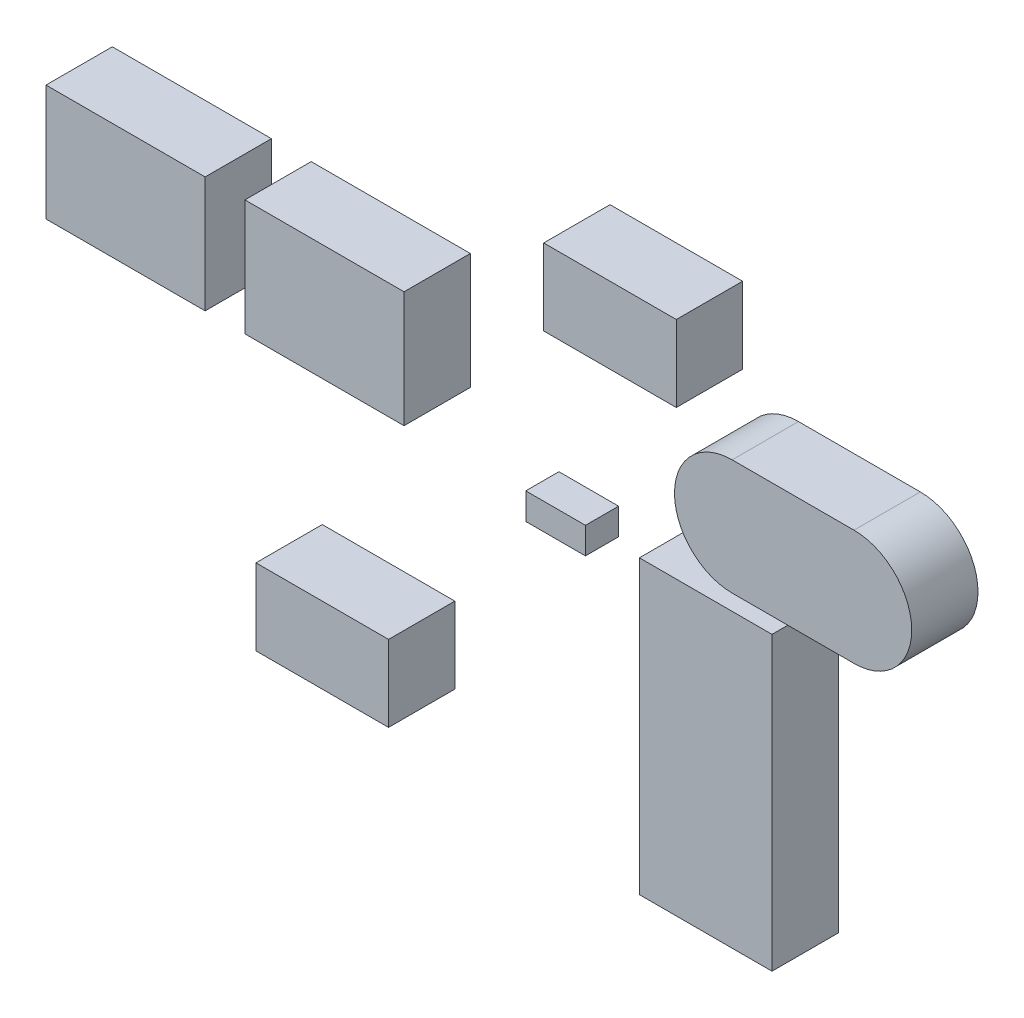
ISO-10303-21;
HEADER;
FILE_DESCRIPTION(('STEP AP214'),'2;1');
FILE_NAME('part.step','',(''),(''),'','','');
FILE_SCHEMA(('AUTOMOTIVE_DESIGN { 1 0 10303 214 1 1 1 1 }'));
ENDSEC;
DATA;
#1=APPLICATION_CONTEXT('core data for automotive mechanical design processes');
#2=APPLICATION_PROTOCOL_DEFINITION('international standard','automotive_design',2000,#1);
#3=PRODUCT_CONTEXT('',#1,'mechanical');
#4=PRODUCT('Part','Part','',(#3));
#5=PRODUCT_RELATED_PRODUCT_CATEGORY('part','',(#4));
#6=PRODUCT_DEFINITION_FORMATION('','',#4);
#7=PRODUCT_DEFINITION_CONTEXT('part definition',#1,'design');
#8=PRODUCT_DEFINITION('design','',#6,#7);
#9=PRODUCT_DEFINITION_SHAPE('','',#8);
#10=(LENGTH_UNIT() NAMED_UNIT(*) SI_UNIT(.MILLI.,.METRE.));
#11=(NAMED_UNIT(*) PLANE_ANGLE_UNIT() SI_UNIT($,.RADIAN.));
#12=(NAMED_UNIT(*) SI_UNIT($,.STERADIAN.) SOLID_ANGLE_UNIT());
#13=UNCERTAINTY_MEASURE_WITH_UNIT(LENGTH_MEASURE(1.E-05),#10,'distance_accuracy_value','');
#14=(GEOMETRIC_REPRESENTATION_CONTEXT(3) GLOBAL_UNCERTAINTY_ASSIGNED_CONTEXT((#13)) GLOBAL_UNIT_ASSIGNED_CONTEXT((#10,
#11,#12)) REPRESENTATION_CONTEXT('',''));
#15=CARTESIAN_POINT('',(0.,0.,0.));
#16=DIRECTION('',(0.,0.,1.));
#17=DIRECTION('',(1.,0.,0.));
#18=AXIS2_PLACEMENT_3D('',#15,#16,#17);
#19=CARTESIAN_POINT('',(10.5501527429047,30.8200326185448,2.));
#20=DIRECTION('',(1.,0.,0.));
#21=DIRECTION('',(0.,0.,-1.));
#22=AXIS2_PLACEMENT_3D('',#19,#20,#21);
#23=PLANE('',#22);
#24=DIRECTION('',(0.,-1.,0.));
#25=VECTOR('',#24,1.);
#26=CARTESIAN_POINT('',(10.5501527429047,30.8200326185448,0.));
#27=LINE('',#26,#25);
#28=CARTESIAN_POINT('',(10.5501527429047,30.8200326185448,0.));
#29=VERTEX_POINT('',#28);
#30=CARTESIAN_POINT('',(10.5501527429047,27.3200326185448,0.));
#31=VERTEX_POINT('',#30);
#32=EDGE_CURVE('P0_E80',#29,#31,#27,.T.);
#33=ORIENTED_EDGE('',*,*,#32,.T.);
#34=DIRECTION('',(0.,0.,-1.));
#35=VECTOR('',#34,1.);
#36=CARTESIAN_POINT('',(10.5501527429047,27.3200326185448,2.));
#37=LINE('',#36,#35);
#38=CARTESIAN_POINT('',(10.5501527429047,27.3200326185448,2.));
#39=VERTEX_POINT('',#38);
#40=EDGE_CURVE('P0_E11',#39,#31,#37,.T.);
#41=ORIENTED_EDGE('',*,*,#40,.F.);
#42=DIRECTION('',(0.,-1.,0.));
#43=VECTOR('',#42,1.);
#44=CARTESIAN_POINT('',(10.5501527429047,30.8200326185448,2.));
#45=LINE('',#44,#43);
#46=CARTESIAN_POINT('',(10.5501527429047,30.8200326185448,2.));
#47=VERTEX_POINT('',#46);
#48=EDGE_CURVE('P0_E68',#47,#39,#45,.T.);
#49=ORIENTED_EDGE('',*,*,#48,.F.);
#50=DIRECTION('',(0.,0.,-1.));
#51=VECTOR('',#50,1.);
#52=CARTESIAN_POINT('',(10.5501527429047,30.8200326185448,2.));
#53=LINE('',#52,#51);
#54=EDGE_CURVE('P0_E76',#47,#29,#53,.T.);
#55=ORIENTED_EDGE('',*,*,#54,.T.);
#56=EDGE_LOOP('',(#33,#41,#49,#55));
#57=FACE_BOUND('',#56,.T.);
#58=ADVANCED_FACE('P0_F17',(#57),#23,.F.);
#59=CARTESIAN_POINT('',(10.5501527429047,27.3200326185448,2.));
#60=DIRECTION('',(0.,1.,0.));
#61=DIRECTION('',(0.,0.,1.));
#62=AXIS2_PLACEMENT_3D('',#59,#60,#61);
#63=PLANE('',#62);
#64=DIRECTION('',(1.,0.,0.));
#65=VECTOR('',#64,1.);
#66=CARTESIAN_POINT('',(10.5501527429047,27.3200326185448,0.));
#67=LINE('',#66,#65);
#68=CARTESIAN_POINT('',(15.3501527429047,27.3200326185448,0.));
#69=VERTEX_POINT('',#68);
#70=EDGE_CURVE('P0_E72',#31,#69,#67,.T.);
#71=ORIENTED_EDGE('',*,*,#70,.T.);
#72=DIRECTION('',(0.,0.,-1.));
#73=VECTOR('',#72,1.);
#74=CARTESIAN_POINT('',(15.3501527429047,27.3200326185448,2.));
#75=LINE('',#74,#73);
#76=CARTESIAN_POINT('',(15.3501527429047,27.3200326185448,2.));
#77=VERTEX_POINT('',#76);
#78=EDGE_CURVE('P0_E25',#77,#69,#75,.T.);
#79=ORIENTED_EDGE('',*,*,#78,.F.);
#80=DIRECTION('',(1.,0.,0.));
#81=VECTOR('',#80,1.);
#82=CARTESIAN_POINT('',(10.5501527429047,27.3200326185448,2.));
#83=LINE('',#82,#81);
#84=EDGE_CURVE('P0_E63',#39,#77,#83,.T.);
#85=ORIENTED_EDGE('',*,*,#84,.F.);
#86=ORIENTED_EDGE('',*,*,#40,.T.);
#87=EDGE_LOOP('',(#71,#79,#85,#86));
#88=FACE_BOUND('',#87,.T.);
#89=ADVANCED_FACE('P0_F71',(#88),#63,.F.);
#90=CARTESIAN_POINT('',(15.3501527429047,30.8200326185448,2.));
#91=DIRECTION('',(-1.,0.,0.));
#92=DIRECTION('',(0.,0.,1.));
#93=AXIS2_PLACEMENT_3D('',#90,#91,#92);
#94=PLANE('',#93);
#95=DIRECTION('',(0.,1.,0.));
#96=VECTOR('',#95,1.);
#97=CARTESIAN_POINT('',(15.3501527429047,30.8200326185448,0.));
#98=LINE('',#97,#96);
#99=CARTESIAN_POINT('',(15.3501527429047,30.8200326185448,0.));
#100=VERTEX_POINT('',#99);
#101=EDGE_CURVE('P0_E50',#69,#100,#98,.T.);
#102=ORIENTED_EDGE('',*,*,#101,.T.);
#103=DIRECTION('',(0.,0.,-1.));
#104=VECTOR('',#103,1.);
#105=CARTESIAN_POINT('',(15.3501527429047,30.8200326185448,2.));
#106=LINE('',#105,#104);
#107=CARTESIAN_POINT('',(15.3501527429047,30.8200326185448,2.));
#108=VERTEX_POINT('',#107);
#109=EDGE_CURVE('P0_E73',#108,#100,#106,.T.);
#110=ORIENTED_EDGE('',*,*,#109,.F.);
#111=DIRECTION('',(0.,1.,0.));
#112=VECTOR('',#111,1.);
#113=CARTESIAN_POINT('',(15.3501527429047,30.8200326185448,2.));
#114=LINE('',#113,#112);
#115=EDGE_CURVE('P0_E66',#77,#108,#114,.T.);
#116=ORIENTED_EDGE('',*,*,#115,.F.);
#117=ORIENTED_EDGE('',*,*,#78,.T.);
#118=EDGE_LOOP('',(#102,#110,#116,#117));
#119=FACE_BOUND('',#118,.T.);
#120=ADVANCED_FACE('P0_F74',(#119),#94,.F.);
#121=CARTESIAN_POINT('',(10.5501527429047,30.8200326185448,2.));
#122=DIRECTION('',(0.,-1.,0.));
#123=DIRECTION('',(0.,0.,-1.));
#124=AXIS2_PLACEMENT_3D('',#121,#122,#123);
#125=PLANE('',#124);
#126=DIRECTION('',(-1.,0.,0.));
#127=VECTOR('',#126,1.);
#128=CARTESIAN_POINT('',(10.5501527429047,30.8200326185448,0.));
#129=LINE('',#128,#127);
#130=EDGE_CURVE('P0_E56',#100,#29,#129,.T.);
#131=ORIENTED_EDGE('',*,*,#130,.T.);
#132=ORIENTED_EDGE('',*,*,#54,.F.);
#133=DIRECTION('',(-1.,0.,0.));
#134=VECTOR('',#133,1.);
#135=CARTESIAN_POINT('',(10.5501527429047,30.8200326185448,2.));
#136=LINE('',#135,#134);
#137=EDGE_CURVE('P0_E33',#108,#47,#136,.T.);
#138=ORIENTED_EDGE('',*,*,#137,.F.);
#139=ORIENTED_EDGE('',*,*,#109,.T.);
#140=EDGE_LOOP('',(#131,#132,#138,#139));
#141=FACE_BOUND('',#140,.T.);
#142=ADVANCED_FACE('P0_F87',(#141),#125,.F.);
#143=CARTESIAN_POINT('',(0.,0.,2.));
#144=DIRECTION('',(0.,0.,1.));
#145=DIRECTION('',(1.,0.,0.));
#146=AXIS2_PLACEMENT_3D('',#143,#144,#145);
#147=PLANE('',#146);
#148=ORIENTED_EDGE('',*,*,#48,.T.);
#149=ORIENTED_EDGE('',*,*,#84,.T.);
#150=ORIENTED_EDGE('',*,*,#115,.T.);
#151=ORIENTED_EDGE('',*,*,#137,.T.);
#152=EDGE_LOOP('',(#148,#149,#150,#151));
#153=FACE_BOUND('',#152,.T.);
#154=ADVANCED_FACE('P0_F64',(#153),#147,.T.);
#155=CARTESIAN_POINT('',(0.,0.,0.));
#156=DIRECTION('',(0.,0.,1.));
#157=DIRECTION('',(1.,0.,0.));
#158=AXIS2_PLACEMENT_3D('',#155,#156,#157);
#159=PLANE('',#158);
#160=ORIENTED_EDGE('',*,*,#32,.F.);
#161=ORIENTED_EDGE('',*,*,#130,.F.);
#162=ORIENTED_EDGE('',*,*,#101,.F.);
#163=ORIENTED_EDGE('',*,*,#70,.F.);
#164=EDGE_LOOP('',(#160,#161,#162,#163));
#165=FACE_BOUND('',#164,.T.);
#166=ADVANCED_FACE('P0_F90',(#165),#159,.F.);
#167=CLOSED_SHELL('',(#58,#89,#120,#142,#154,#166));
#168=MANIFOLD_SOLID_BREP('P0_B1',#167);
#169=CARTESIAN_POINT('',(16.5501527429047,30.8200326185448,2.));
#170=DIRECTION('',(1.,0.,0.));
#171=DIRECTION('',(0.,0.,-1.));
#172=AXIS2_PLACEMENT_3D('',#169,#170,#171);
#173=PLANE('',#172);
#174=DIRECTION('',(0.,-1.,0.));
#175=VECTOR('',#174,1.);
#176=CARTESIAN_POINT('',(16.5501527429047,30.8200326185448,0.));
#177=LINE('',#176,#175);
#178=CARTESIAN_POINT('',(16.5501527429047,30.8200326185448,0.));
#179=VERTEX_POINT('',#178);
#180=CARTESIAN_POINT('',(16.5501527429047,27.3200326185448,0.));
#181=VERTEX_POINT('',#180);
#182=EDGE_CURVE('P1_E80',#179,#181,#177,.T.);
#183=ORIENTED_EDGE('',*,*,#182,.T.);
#184=DIRECTION('',(0.,0.,-1.));
#185=VECTOR('',#184,1.);
#186=CARTESIAN_POINT('',(16.5501527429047,27.3200326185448,2.));
#187=LINE('',#186,#185);
#188=CARTESIAN_POINT('',(16.5501527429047,27.3200326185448,2.));
#189=VERTEX_POINT('',#188);
#190=EDGE_CURVE('P1_E11',#189,#181,#187,.T.);
#191=ORIENTED_EDGE('',*,*,#190,.F.);
#192=DIRECTION('',(0.,-1.,0.));
#193=VECTOR('',#192,1.);
#194=CARTESIAN_POINT('',(16.5501527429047,30.8200326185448,2.));
#195=LINE('',#194,#193);
#196=CARTESIAN_POINT('',(16.5501527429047,30.8200326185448,2.));
#197=VERTEX_POINT('',#196);
#198=EDGE_CURVE('P1_E68',#197,#189,#195,.T.);
#199=ORIENTED_EDGE('',*,*,#198,.F.);
#200=DIRECTION('',(0.,0.,-1.));
#201=VECTOR('',#200,1.);
#202=CARTESIAN_POINT('',(16.5501527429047,30.8200326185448,2.));
#203=LINE('',#202,#201);
#204=EDGE_CURVE('P1_E76',#197,#179,#203,.T.);
#205=ORIENTED_EDGE('',*,*,#204,.T.);
#206=EDGE_LOOP('',(#183,#191,#199,#205));
#207=FACE_BOUND('',#206,.T.);
#208=ADVANCED_FACE('P1_F17',(#207),#173,.F.);
#209=CARTESIAN_POINT('',(16.5501527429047,27.3200326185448,2.));
#210=DIRECTION('',(0.,1.,0.));
#211=DIRECTION('',(0.,0.,1.));
#212=AXIS2_PLACEMENT_3D('',#209,#210,#211);
#213=PLANE('',#212);
#214=DIRECTION('',(1.,0.,0.));
#215=VECTOR('',#214,1.);
#216=CARTESIAN_POINT('',(16.5501527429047,27.3200326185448,0.));
#217=LINE('',#216,#215);
#218=CARTESIAN_POINT('',(21.3501527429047,27.3200326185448,0.));
#219=VERTEX_POINT('',#218);
#220=EDGE_CURVE('P1_E72',#181,#219,#217,.T.);
#221=ORIENTED_EDGE('',*,*,#220,.T.);
#222=DIRECTION('',(0.,0.,-1.));
#223=VECTOR('',#222,1.);
#224=CARTESIAN_POINT('',(21.3501527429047,27.3200326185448,2.));
#225=LINE('',#224,#223);
#226=CARTESIAN_POINT('',(21.3501527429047,27.3200326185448,2.));
#227=VERTEX_POINT('',#226);
#228=EDGE_CURVE('P1_E25',#227,#219,#225,.T.);
#229=ORIENTED_EDGE('',*,*,#228,.F.);
#230=DIRECTION('',(1.,0.,0.));
#231=VECTOR('',#230,1.);
#232=CARTESIAN_POINT('',(16.5501527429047,27.3200326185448,2.));
#233=LINE('',#232,#231);
#234=EDGE_CURVE('P1_E63',#189,#227,#233,.T.);
#235=ORIENTED_EDGE('',*,*,#234,.F.);
#236=ORIENTED_EDGE('',*,*,#190,.T.);
#237=EDGE_LOOP('',(#221,#229,#235,#236));
#238=FACE_BOUND('',#237,.T.);
#239=ADVANCED_FACE('P1_F71',(#238),#213,.F.);
#240=CARTESIAN_POINT('',(21.3501527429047,30.8200326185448,2.));
#241=DIRECTION('',(-1.,0.,0.));
#242=DIRECTION('',(0.,0.,1.));
#243=AXIS2_PLACEMENT_3D('',#240,#241,#242);
#244=PLANE('',#243);
#245=DIRECTION('',(0.,1.,0.));
#246=VECTOR('',#245,1.);
#247=CARTESIAN_POINT('',(21.3501527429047,30.8200326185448,0.));
#248=LINE('',#247,#246);
#249=CARTESIAN_POINT('',(21.3501527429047,30.8200326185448,0.));
#250=VERTEX_POINT('',#249);
#251=EDGE_CURVE('P1_E50',#219,#250,#248,.T.);
#252=ORIENTED_EDGE('',*,*,#251,.T.);
#253=DIRECTION('',(0.,0.,-1.));
#254=VECTOR('',#253,1.);
#255=CARTESIAN_POINT('',(21.3501527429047,30.8200326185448,2.));
#256=LINE('',#255,#254);
#257=CARTESIAN_POINT('',(21.3501527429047,30.8200326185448,2.));
#258=VERTEX_POINT('',#257);
#259=EDGE_CURVE('P1_E73',#258,#250,#256,.T.);
#260=ORIENTED_EDGE('',*,*,#259,.F.);
#261=DIRECTION('',(0.,1.,0.));
#262=VECTOR('',#261,1.);
#263=CARTESIAN_POINT('',(21.3501527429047,30.8200326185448,2.));
#264=LINE('',#263,#262);
#265=EDGE_CURVE('P1_E66',#227,#258,#264,.T.);
#266=ORIENTED_EDGE('',*,*,#265,.F.);
#267=ORIENTED_EDGE('',*,*,#228,.T.);
#268=EDGE_LOOP('',(#252,#260,#266,#267));
#269=FACE_BOUND('',#268,.T.);
#270=ADVANCED_FACE('P1_F74',(#269),#244,.F.);
#271=CARTESIAN_POINT('',(16.5501527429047,30.8200326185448,2.));
#272=DIRECTION('',(0.,-1.,0.));
#273=DIRECTION('',(0.,0.,-1.));
#274=AXIS2_PLACEMENT_3D('',#271,#272,#273);
#275=PLANE('',#274);
#276=DIRECTION('',(-1.,0.,0.));
#277=VECTOR('',#276,1.);
#278=CARTESIAN_POINT('',(16.5501527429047,30.8200326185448,0.));
#279=LINE('',#278,#277);
#280=EDGE_CURVE('P1_E56',#250,#179,#279,.T.);
#281=ORIENTED_EDGE('',*,*,#280,.T.);
#282=ORIENTED_EDGE('',*,*,#204,.F.);
#283=DIRECTION('',(-1.,0.,0.));
#284=VECTOR('',#283,1.);
#285=CARTESIAN_POINT('',(16.5501527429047,30.8200326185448,2.));
#286=LINE('',#285,#284);
#287=EDGE_CURVE('P1_E33',#258,#197,#286,.T.);
#288=ORIENTED_EDGE('',*,*,#287,.F.);
#289=ORIENTED_EDGE('',*,*,#259,.T.);
#290=EDGE_LOOP('',(#281,#282,#288,#289));
#291=FACE_BOUND('',#290,.T.);
#292=ADVANCED_FACE('P1_F87',(#291),#275,.F.);
#293=CARTESIAN_POINT('',(0.,0.,2.));
#294=DIRECTION('',(0.,0.,1.));
#295=DIRECTION('',(1.,0.,0.));
#296=AXIS2_PLACEMENT_3D('',#293,#294,#295);
#297=PLANE('',#296);
#298=ORIENTED_EDGE('',*,*,#198,.T.);
#299=ORIENTED_EDGE('',*,*,#234,.T.);
#300=ORIENTED_EDGE('',*,*,#265,.T.);
#301=ORIENTED_EDGE('',*,*,#287,.T.);
#302=EDGE_LOOP('',(#298,#299,#300,#301));
#303=FACE_BOUND('',#302,.T.);
#304=ADVANCED_FACE('P1_F64',(#303),#297,.T.);
#305=CARTESIAN_POINT('',(0.,0.,0.));
#306=DIRECTION('',(0.,0.,1.));
#307=DIRECTION('',(1.,0.,0.));
#308=AXIS2_PLACEMENT_3D('',#305,#306,#307);
#309=PLANE('',#308);
#310=ORIENTED_EDGE('',*,*,#182,.F.);
#311=ORIENTED_EDGE('',*,*,#280,.F.);
#312=ORIENTED_EDGE('',*,*,#251,.F.);
#313=ORIENTED_EDGE('',*,*,#220,.F.);
#314=EDGE_LOOP('',(#310,#311,#312,#313));
#315=FACE_BOUND('',#314,.T.);
#316=ADVANCED_FACE('P1_F90',(#315),#309,.F.);
#317=CLOSED_SHELL('',(#208,#239,#270,#292,#304,#316));
#318=MANIFOLD_SOLID_BREP('P1_B1',#317);
#319=CARTESIAN_POINT('',(28.4501527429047,27.4200326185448,2.));
#320=DIRECTION('',(1.,0.,0.));
#321=DIRECTION('',(0.,0.,-1.));
#322=AXIS2_PLACEMENT_3D('',#319,#320,#321);
#323=PLANE('',#322);
#324=DIRECTION('',(0.,-1.,0.));
#325=VECTOR('',#324,1.);
#326=CARTESIAN_POINT('',(28.4501527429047,27.4200326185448,0.));
#327=LINE('',#326,#325);
#328=CARTESIAN_POINT('',(28.4501527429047,27.4200326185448,0.));
#329=VERTEX_POINT('',#328);
#330=CARTESIAN_POINT('',(28.4501527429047,18.6200326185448,0.));
#331=VERTEX_POINT('',#330);
#332=EDGE_CURVE('P2_E80',#329,#331,#327,.T.);
#333=ORIENTED_EDGE('',*,*,#332,.T.);
#334=DIRECTION('',(0.,0.,-1.));
#335=VECTOR('',#334,1.);
#336=CARTESIAN_POINT('',(28.4501527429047,18.6200326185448,2.));
#337=LINE('',#336,#335);
#338=CARTESIAN_POINT('',(28.4501527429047,18.6200326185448,2.));
#339=VERTEX_POINT('',#338);
#340=EDGE_CURVE('P2_E11',#339,#331,#337,.T.);
#341=ORIENTED_EDGE('',*,*,#340,.F.);
#342=DIRECTION('',(0.,-1.,0.));
#343=VECTOR('',#342,1.);
#344=CARTESIAN_POINT('',(28.4501527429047,27.4200326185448,2.));
#345=LINE('',#344,#343);
#346=CARTESIAN_POINT('',(28.4501527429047,27.4200326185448,2.));
#347=VERTEX_POINT('',#346);
#348=EDGE_CURVE('P2_E68',#347,#339,#345,.T.);
#349=ORIENTED_EDGE('',*,*,#348,.F.);
#350=DIRECTION('',(0.,0.,-1.));
#351=VECTOR('',#350,1.);
#352=CARTESIAN_POINT('',(28.4501527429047,27.4200326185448,2.));
#353=LINE('',#352,#351);
#354=EDGE_CURVE('P2_E76',#347,#329,#353,.T.);
#355=ORIENTED_EDGE('',*,*,#354,.T.);
#356=EDGE_LOOP('',(#333,#341,#349,#355));
#357=FACE_BOUND('',#356,.T.);
#358=ADVANCED_FACE('P2_F17',(#357),#323,.F.);
#359=CARTESIAN_POINT('',(28.4501527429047,18.6200326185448,2.));
#360=DIRECTION('',(0.,1.,0.));
#361=DIRECTION('',(0.,0.,1.));
#362=AXIS2_PLACEMENT_3D('',#359,#360,#361);
#363=PLANE('',#362);
#364=DIRECTION('',(1.,0.,0.));
#365=VECTOR('',#364,1.);
#366=CARTESIAN_POINT('',(28.4501527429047,18.6200326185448,0.));
#367=LINE('',#366,#365);
#368=CARTESIAN_POINT('',(32.4501527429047,18.6200326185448,0.));
#369=VERTEX_POINT('',#368);
#370=EDGE_CURVE('P2_E72',#331,#369,#367,.T.);
#371=ORIENTED_EDGE('',*,*,#370,.T.);
#372=DIRECTION('',(0.,0.,-1.));
#373=VECTOR('',#372,1.);
#374=CARTESIAN_POINT('',(32.4501527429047,18.6200326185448,2.));
#375=LINE('',#374,#373);
#376=CARTESIAN_POINT('',(32.4501527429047,18.6200326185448,2.));
#377=VERTEX_POINT('',#376);
#378=EDGE_CURVE('P2_E25',#377,#369,#375,.T.);
#379=ORIENTED_EDGE('',*,*,#378,.F.);
#380=DIRECTION('',(1.,0.,0.));
#381=VECTOR('',#380,1.);
#382=CARTESIAN_POINT('',(28.4501527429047,18.6200326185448,2.));
#383=LINE('',#382,#381);
#384=EDGE_CURVE('P2_E63',#339,#377,#383,.T.);
#385=ORIENTED_EDGE('',*,*,#384,.F.);
#386=ORIENTED_EDGE('',*,*,#340,.T.);
#387=EDGE_LOOP('',(#371,#379,#385,#386));
#388=FACE_BOUND('',#387,.T.);
#389=ADVANCED_FACE('P2_F71',(#388),#363,.F.);
#390=CARTESIAN_POINT('',(32.4501527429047,27.4200326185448,2.));
#391=DIRECTION('',(-1.,0.,0.));
#392=DIRECTION('',(0.,0.,1.));
#393=AXIS2_PLACEMENT_3D('',#390,#391,#392);
#394=PLANE('',#393);
#395=DIRECTION('',(0.,1.,0.));
#396=VECTOR('',#395,1.);
#397=CARTESIAN_POINT('',(32.4501527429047,27.4200326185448,0.));
#398=LINE('',#397,#396);
#399=CARTESIAN_POINT('',(32.4501527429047,27.4200326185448,0.));
#400=VERTEX_POINT('',#399);
#401=EDGE_CURVE('P2_E50',#369,#400,#398,.T.);
#402=ORIENTED_EDGE('',*,*,#401,.T.);
#403=DIRECTION('',(0.,0.,-1.));
#404=VECTOR('',#403,1.);
#405=CARTESIAN_POINT('',(32.4501527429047,27.4200326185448,2.));
#406=LINE('',#405,#404);
#407=CARTESIAN_POINT('',(32.4501527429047,27.4200326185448,2.));
#408=VERTEX_POINT('',#407);
#409=EDGE_CURVE('P2_E73',#408,#400,#406,.T.);
#410=ORIENTED_EDGE('',*,*,#409,.F.);
#411=DIRECTION('',(0.,1.,0.));
#412=VECTOR('',#411,1.);
#413=CARTESIAN_POINT('',(32.4501527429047,27.4200326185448,2.));
#414=LINE('',#413,#412);
#415=EDGE_CURVE('P2_E66',#377,#408,#414,.T.);
#416=ORIENTED_EDGE('',*,*,#415,.F.);
#417=ORIENTED_EDGE('',*,*,#378,.T.);
#418=EDGE_LOOP('',(#402,#410,#416,#417));
#419=FACE_BOUND('',#418,.T.);
#420=ADVANCED_FACE('P2_F74',(#419),#394,.F.);
#421=CARTESIAN_POINT('',(28.4501527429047,27.4200326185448,2.));
#422=DIRECTION('',(0.,-1.,0.));
#423=DIRECTION('',(0.,0.,-1.));
#424=AXIS2_PLACEMENT_3D('',#421,#422,#423);
#425=PLANE('',#424);
#426=DIRECTION('',(-1.,0.,0.));
#427=VECTOR('',#426,1.);
#428=CARTESIAN_POINT('',(28.4501527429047,27.4200326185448,0.));
#429=LINE('',#428,#427);
#430=EDGE_CURVE('P2_E56',#400,#329,#429,.T.);
#431=ORIENTED_EDGE('',*,*,#430,.T.);
#432=ORIENTED_EDGE('',*,*,#354,.F.);
#433=DIRECTION('',(-1.,0.,0.));
#434=VECTOR('',#433,1.);
#435=CARTESIAN_POINT('',(28.4501527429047,27.4200326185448,2.));
#436=LINE('',#435,#434);
#437=EDGE_CURVE('P2_E33',#408,#347,#436,.T.);
#438=ORIENTED_EDGE('',*,*,#437,.F.);
#439=ORIENTED_EDGE('',*,*,#409,.T.);
#440=EDGE_LOOP('',(#431,#432,#438,#439));
#441=FACE_BOUND('',#440,.T.);
#442=ADVANCED_FACE('P2_F87',(#441),#425,.F.);
#443=CARTESIAN_POINT('',(0.,0.,2.));
#444=DIRECTION('',(0.,0.,1.));
#445=DIRECTION('',(1.,0.,0.));
#446=AXIS2_PLACEMENT_3D('',#443,#444,#445);
#447=PLANE('',#446);
#448=ORIENTED_EDGE('',*,*,#348,.T.);
#449=ORIENTED_EDGE('',*,*,#384,.T.);
#450=ORIENTED_EDGE('',*,*,#415,.T.);
#451=ORIENTED_EDGE('',*,*,#437,.T.);
#452=EDGE_LOOP('',(#448,#449,#450,#451));
#453=FACE_BOUND('',#452,.T.);
#454=ADVANCED_FACE('P2_F64',(#453),#447,.T.);
#455=CARTESIAN_POINT('',(0.,0.,0.));
#456=DIRECTION('',(0.,0.,1.));
#457=DIRECTION('',(1.,0.,0.));
#458=AXIS2_PLACEMENT_3D('',#455,#456,#457);
#459=PLANE('',#458);
#460=ORIENTED_EDGE('',*,*,#332,.F.);
#461=ORIENTED_EDGE('',*,*,#430,.F.);
#462=ORIENTED_EDGE('',*,*,#401,.F.);
#463=ORIENTED_EDGE('',*,*,#370,.F.);
#464=EDGE_LOOP('',(#460,#461,#462,#463));
#465=FACE_BOUND('',#464,.T.);
#466=ADVANCED_FACE('P2_F90',(#465),#459,.F.);
#467=CLOSED_SHELL('',(#358,#389,#420,#442,#454,#466));
#468=MANIFOLD_SOLID_BREP('P2_B1',#467);
#469=CARTESIAN_POINT('',(29.5633014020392,34.2019934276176,2.));
#470=DIRECTION('',(-1.,0.,0.));
#471=DIRECTION('',(0.,0.,1.));
#472=AXIS2_PLACEMENT_3D('',#469,#470,#471);
#473=PLANE('',#472);
#474=DIRECTION('',(0.,1.,0.));
#475=VECTOR('',#474,1.);
#476=CARTESIAN_POINT('',(29.5633014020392,34.2019934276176,0.));
#477=LINE('',#476,#475);
#478=CARTESIAN_POINT('',(29.5633014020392,31.9019934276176,0.));
#479=VERTEX_POINT('',#478);
#480=CARTESIAN_POINT('',(29.5633014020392,34.2019934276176,0.));
#481=VERTEX_POINT('',#480);
#482=EDGE_CURVE('P3_E80',#479,#481,#477,.T.);
#483=ORIENTED_EDGE('',*,*,#482,.T.);
#484=DIRECTION('',(0.,0.,-1.));
#485=VECTOR('',#484,1.);
#486=CARTESIAN_POINT('',(29.5633014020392,34.2019934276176,2.));
#487=LINE('',#486,#485);
#488=CARTESIAN_POINT('',(29.5633014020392,34.2019934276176,2.));
#489=VERTEX_POINT('',#488);
#490=EDGE_CURVE('P3_E11',#489,#481,#487,.T.);
#491=ORIENTED_EDGE('',*,*,#490,.F.);
#492=DIRECTION('',(0.,1.,0.));
#493=VECTOR('',#492,1.);
#494=CARTESIAN_POINT('',(29.5633014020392,34.2019934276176,2.));
#495=LINE('',#494,#493);
#496=CARTESIAN_POINT('',(29.5633014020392,31.9019934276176,2.));
#497=VERTEX_POINT('',#496);
#498=EDGE_CURVE('P3_E68',#497,#489,#495,.T.);
#499=ORIENTED_EDGE('',*,*,#498,.F.);
#500=DIRECTION('',(0.,0.,-1.));
#501=VECTOR('',#500,1.);
#502=CARTESIAN_POINT('',(29.5633014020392,31.9019934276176,2.));
#503=LINE('',#502,#501);
#504=EDGE_CURVE('P3_E76',#497,#479,#503,.T.);
#505=ORIENTED_EDGE('',*,*,#504,.T.);
#506=EDGE_LOOP('',(#483,#491,#499,#505));
#507=FACE_BOUND('',#506,.T.);
#508=ADVANCED_FACE('P3_F17',(#507),#473,.F.);
#509=CARTESIAN_POINT('',(29.5633014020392,34.2019934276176,2.));
#510=DIRECTION('',(0.,-1.,0.));
#511=DIRECTION('',(0.,0.,-1.));
#512=AXIS2_PLACEMENT_3D('',#509,#510,#511);
#513=PLANE('',#512);
#514=DIRECTION('',(-1.,0.,0.));
#515=VECTOR('',#514,1.);
#516=CARTESIAN_POINT('',(29.5633014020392,34.2019934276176,0.));
#517=LINE('',#516,#515);
#518=CARTESIAN_POINT('',(25.5633014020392,34.2019934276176,0.));
#519=VERTEX_POINT('',#518);
#520=EDGE_CURVE('P3_E72',#481,#519,#517,.T.);
#521=ORIENTED_EDGE('',*,*,#520,.T.);
#522=DIRECTION('',(0.,0.,-1.));
#523=VECTOR('',#522,1.);
#524=CARTESIAN_POINT('',(25.5633014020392,34.2019934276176,2.));
#525=LINE('',#524,#523);
#526=CARTESIAN_POINT('',(25.5633014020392,34.2019934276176,2.));
#527=VERTEX_POINT('',#526);
#528=EDGE_CURVE('P3_E25',#527,#519,#525,.T.);
#529=ORIENTED_EDGE('',*,*,#528,.F.);
#530=DIRECTION('',(-1.,0.,0.));
#531=VECTOR('',#530,1.);
#532=CARTESIAN_POINT('',(29.5633014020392,34.2019934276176,2.));
#533=LINE('',#532,#531);
#534=EDGE_CURVE('P3_E63',#489,#527,#533,.T.);
#535=ORIENTED_EDGE('',*,*,#534,.F.);
#536=ORIENTED_EDGE('',*,*,#490,.T.);
#537=EDGE_LOOP('',(#521,#529,#535,#536));
#538=FACE_BOUND('',#537,.T.);
#539=ADVANCED_FACE('P3_F71',(#538),#513,.F.);
#540=CARTESIAN_POINT('',(25.5633014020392,34.2019934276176,2.));
#541=DIRECTION('',(1.,0.,0.));
#542=DIRECTION('',(0.,0.,-1.));
#543=AXIS2_PLACEMENT_3D('',#540,#541,#542);
#544=PLANE('',#543);
#545=DIRECTION('',(0.,-1.,0.));
#546=VECTOR('',#545,1.);
#547=CARTESIAN_POINT('',(25.5633014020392,34.2019934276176,0.));
#548=LINE('',#547,#546);
#549=CARTESIAN_POINT('',(25.5633014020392,31.9019934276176,0.));
#550=VERTEX_POINT('',#549);
#551=EDGE_CURVE('P3_E50',#519,#550,#548,.T.);
#552=ORIENTED_EDGE('',*,*,#551,.T.);
#553=DIRECTION('',(0.,0.,-1.));
#554=VECTOR('',#553,1.);
#555=CARTESIAN_POINT('',(25.5633014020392,31.9019934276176,2.));
#556=LINE('',#555,#554);
#557=CARTESIAN_POINT('',(25.5633014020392,31.9019934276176,2.));
#558=VERTEX_POINT('',#557);
#559=EDGE_CURVE('P3_E73',#558,#550,#556,.T.);
#560=ORIENTED_EDGE('',*,*,#559,.F.);
#561=DIRECTION('',(0.,-1.,0.));
#562=VECTOR('',#561,1.);
#563=CARTESIAN_POINT('',(25.5633014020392,34.2019934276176,2.));
#564=LINE('',#563,#562);
#565=EDGE_CURVE('P3_E66',#527,#558,#564,.T.);
#566=ORIENTED_EDGE('',*,*,#565,.F.);
#567=ORIENTED_EDGE('',*,*,#528,.T.);
#568=EDGE_LOOP('',(#552,#560,#566,#567));
#569=FACE_BOUND('',#568,.T.);
#570=ADVANCED_FACE('P3_F74',(#569),#544,.F.);
#571=CARTESIAN_POINT('',(29.5633014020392,31.9019934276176,2.));
#572=DIRECTION('',(0.,1.,0.));
#573=DIRECTION('',(0.,0.,1.));
#574=AXIS2_PLACEMENT_3D('',#571,#572,#573);
#575=PLANE('',#574);
#576=DIRECTION('',(1.,0.,0.));
#577=VECTOR('',#576,1.);
#578=CARTESIAN_POINT('',(29.5633014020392,31.9019934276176,0.));
#579=LINE('',#578,#577);
#580=EDGE_CURVE('P3_E56',#550,#479,#579,.T.);
#581=ORIENTED_EDGE('',*,*,#580,.T.);
#582=ORIENTED_EDGE('',*,*,#504,.F.);
#583=DIRECTION('',(1.,0.,0.));
#584=VECTOR('',#583,1.);
#585=CARTESIAN_POINT('',(29.5633014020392,31.9019934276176,2.));
#586=LINE('',#585,#584);
#587=EDGE_CURVE('P3_E33',#558,#497,#586,.T.);
#588=ORIENTED_EDGE('',*,*,#587,.F.);
#589=ORIENTED_EDGE('',*,*,#559,.T.);
#590=EDGE_LOOP('',(#581,#582,#588,#589));
#591=FACE_BOUND('',#590,.T.);
#592=ADVANCED_FACE('P3_F87',(#591),#575,.F.);
#593=CARTESIAN_POINT('',(0.,0.,2.));
#594=DIRECTION('',(0.,0.,-1.));
#595=DIRECTION('',(-1.,0.,0.));
#596=AXIS2_PLACEMENT_3D('',#593,#594,#595);
#597=PLANE('',#596);
#598=ORIENTED_EDGE('',*,*,#498,.T.);
#599=ORIENTED_EDGE('',*,*,#534,.T.);
#600=ORIENTED_EDGE('',*,*,#565,.T.);
#601=ORIENTED_EDGE('',*,*,#587,.T.);
#602=EDGE_LOOP('',(#598,#599,#600,#601));
#603=FACE_BOUND('',#602,.T.);
#604=ADVANCED_FACE('P3_F64',(#603),#597,.F.);
#605=CARTESIAN_POINT('',(0.,0.,0.));
#606=DIRECTION('',(0.,0.,-1.));
#607=DIRECTION('',(-1.,0.,0.));
#608=AXIS2_PLACEMENT_3D('',#605,#606,#607);
#609=PLANE('',#608);
#610=ORIENTED_EDGE('',*,*,#482,.F.);
#611=ORIENTED_EDGE('',*,*,#580,.F.);
#612=ORIENTED_EDGE('',*,*,#551,.F.);
#613=ORIENTED_EDGE('',*,*,#520,.F.);
#614=EDGE_LOOP('',(#610,#611,#612,#613));
#615=FACE_BOUND('',#614,.T.);
#616=ADVANCED_FACE('P3_F90',(#615),#609,.T.);
#617=CLOSED_SHELL('',(#508,#539,#570,#592,#604,#616));
#618=MANIFOLD_SOLID_BREP('P3_B1',#617);
#619=CARTESIAN_POINT('',(20.8833029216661,21.5053863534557,2.));
#620=DIRECTION('',(-1.,0.,0.));
#621=DIRECTION('',(0.,-1.,0.));
#622=AXIS2_PLACEMENT_3D('',#619,#620,#621);
#623=PLANE('',#622);
#624=DIRECTION('',(0.,1.,0.));
#625=VECTOR('',#624,1.);
#626=CARTESIAN_POINT('',(20.8833029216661,21.5053863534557,0.));
#627=LINE('',#626,#625);
#628=CARTESIAN_POINT('',(20.8833029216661,19.2053863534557,0.));
#629=VERTEX_POINT('',#628);
#630=CARTESIAN_POINT('',(20.8833029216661,21.5053863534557,0.));
#631=VERTEX_POINT('',#630);
#632=EDGE_CURVE('P4_E80',#629,#631,#627,.T.);
#633=ORIENTED_EDGE('',*,*,#632,.T.);
#634=DIRECTION('',(0.,0.,-1.));
#635=VECTOR('',#634,1.);
#636=CARTESIAN_POINT('',(20.8833029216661,21.5053863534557,2.));
#637=LINE('',#636,#635);
#638=CARTESIAN_POINT('',(20.8833029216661,21.5053863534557,2.));
#639=VERTEX_POINT('',#638);
#640=EDGE_CURVE('P4_E11',#639,#631,#637,.T.);
#641=ORIENTED_EDGE('',*,*,#640,.F.);
#642=DIRECTION('',(0.,1.,0.));
#643=VECTOR('',#642,1.);
#644=CARTESIAN_POINT('',(20.8833029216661,21.5053863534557,2.));
#645=LINE('',#644,#643);
#646=CARTESIAN_POINT('',(20.8833029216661,19.2053863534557,2.));
#647=VERTEX_POINT('',#646);
#648=EDGE_CURVE('P4_E68',#647,#639,#645,.T.);
#649=ORIENTED_EDGE('',*,*,#648,.F.);
#650=DIRECTION('',(0.,0.,-1.));
#651=VECTOR('',#650,1.);
#652=CARTESIAN_POINT('',(20.8833029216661,19.2053863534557,2.));
#653=LINE('',#652,#651);
#654=EDGE_CURVE('P4_E76',#647,#629,#653,.T.);
#655=ORIENTED_EDGE('',*,*,#654,.T.);
#656=EDGE_LOOP('',(#633,#641,#649,#655));
#657=FACE_BOUND('',#656,.T.);
#658=ADVANCED_FACE('P4_F17',(#657),#623,.F.);
#659=CARTESIAN_POINT('',(20.8833029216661,21.5053863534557,2.));
#660=DIRECTION('',(0.,-1.,0.));
#661=DIRECTION('',(1.,0.,0.));
#662=AXIS2_PLACEMENT_3D('',#659,#660,#661);
#663=PLANE('',#662);
#664=DIRECTION('',(-1.,0.,0.));
#665=VECTOR('',#664,1.);
#666=CARTESIAN_POINT('',(20.8833029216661,21.5053863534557,0.));
#667=LINE('',#666,#665);
#668=CARTESIAN_POINT('',(16.8833029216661,21.5053863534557,0.));
#669=VERTEX_POINT('',#668);
#670=EDGE_CURVE('P4_E72',#631,#669,#667,.T.);
#671=ORIENTED_EDGE('',*,*,#670,.T.);
#672=DIRECTION('',(0.,0.,-1.));
#673=VECTOR('',#672,1.);
#674=CARTESIAN_POINT('',(16.8833029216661,21.5053863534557,2.));
#675=LINE('',#674,#673);
#676=CARTESIAN_POINT('',(16.8833029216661,21.5053863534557,2.));
#677=VERTEX_POINT('',#676);
#678=EDGE_CURVE('P4_E25',#677,#669,#675,.T.);
#679=ORIENTED_EDGE('',*,*,#678,.F.);
#680=DIRECTION('',(-1.,0.,0.));
#681=VECTOR('',#680,1.);
#682=CARTESIAN_POINT('',(20.8833029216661,21.5053863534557,2.));
#683=LINE('',#682,#681);
#684=EDGE_CURVE('P4_E63',#639,#677,#683,.T.);
#685=ORIENTED_EDGE('',*,*,#684,.F.);
#686=ORIENTED_EDGE('',*,*,#640,.T.);
#687=EDGE_LOOP('',(#671,#679,#685,#686));
#688=FACE_BOUND('',#687,.T.);
#689=ADVANCED_FACE('P4_F71',(#688),#663,.F.);
#690=CARTESIAN_POINT('',(16.8833029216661,21.5053863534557,2.));
#691=DIRECTION('',(1.,0.,0.));
#692=DIRECTION('',(0.,1.,0.));
#693=AXIS2_PLACEMENT_3D('',#690,#691,#692);
#694=PLANE('',#693);
#695=DIRECTION('',(0.,-1.,0.));
#696=VECTOR('',#695,1.);
#697=CARTESIAN_POINT('',(16.8833029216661,21.5053863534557,0.));
#698=LINE('',#697,#696);
#699=CARTESIAN_POINT('',(16.8833029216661,19.2053863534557,0.));
#700=VERTEX_POINT('',#699);
#701=EDGE_CURVE('P4_E50',#669,#700,#698,.T.);
#702=ORIENTED_EDGE('',*,*,#701,.T.);
#703=DIRECTION('',(0.,0.,-1.));
#704=VECTOR('',#703,1.);
#705=CARTESIAN_POINT('',(16.8833029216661,19.2053863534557,2.));
#706=LINE('',#705,#704);
#707=CARTESIAN_POINT('',(16.8833029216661,19.2053863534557,2.));
#708=VERTEX_POINT('',#707);
#709=EDGE_CURVE('P4_E73',#708,#700,#706,.T.);
#710=ORIENTED_EDGE('',*,*,#709,.F.);
#711=DIRECTION('',(0.,-1.,0.));
#712=VECTOR('',#711,1.);
#713=CARTESIAN_POINT('',(16.8833029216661,21.5053863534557,2.));
#714=LINE('',#713,#712);
#715=EDGE_CURVE('P4_E66',#677,#708,#714,.T.);
#716=ORIENTED_EDGE('',*,*,#715,.F.);
#717=ORIENTED_EDGE('',*,*,#678,.T.);
#718=EDGE_LOOP('',(#702,#710,#716,#717));
#719=FACE_BOUND('',#718,.T.);
#720=ADVANCED_FACE('P4_F74',(#719),#694,.F.);
#721=CARTESIAN_POINT('',(20.8833029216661,19.2053863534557,2.));
#722=DIRECTION('',(0.,1.,0.));
#723=DIRECTION('',(0.,0.,1.));
#724=AXIS2_PLACEMENT_3D('',#721,#722,#723);
#725=PLANE('',#724);
#726=DIRECTION('',(1.,0.,0.));
#727=VECTOR('',#726,1.);
#728=CARTESIAN_POINT('',(20.8833029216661,19.2053863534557,0.));
#729=LINE('',#728,#727);
#730=EDGE_CURVE('P4_E56',#700,#629,#729,.T.);
#731=ORIENTED_EDGE('',*,*,#730,.T.);
#732=ORIENTED_EDGE('',*,*,#654,.F.);
#733=DIRECTION('',(1.,0.,0.));
#734=VECTOR('',#733,1.);
#735=CARTESIAN_POINT('',(20.8833029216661,19.2053863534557,2.));
#736=LINE('',#735,#734);
#737=EDGE_CURVE('P4_E33',#708,#647,#736,.T.);
#738=ORIENTED_EDGE('',*,*,#737,.F.);
#739=ORIENTED_EDGE('',*,*,#709,.T.);
#740=EDGE_LOOP('',(#731,#732,#738,#739));
#741=FACE_BOUND('',#740,.T.);
#742=ADVANCED_FACE('P4_F87',(#741),#725,.F.);
#743=CARTESIAN_POINT('',(0.,0.,2.));
#744=DIRECTION('',(0.,0.,-1.));
#745=DIRECTION('',(-1.,0.,0.));
#746=AXIS2_PLACEMENT_3D('',#743,#744,#745);
#747=PLANE('',#746);
#748=ORIENTED_EDGE('',*,*,#648,.T.);
#749=ORIENTED_EDGE('',*,*,#684,.T.);
#750=ORIENTED_EDGE('',*,*,#715,.T.);
#751=ORIENTED_EDGE('',*,*,#737,.T.);
#752=EDGE_LOOP('',(#748,#749,#750,#751));
#753=FACE_BOUND('',#752,.T.);
#754=ADVANCED_FACE('P4_F64',(#753),#747,.F.);
#755=CARTESIAN_POINT('',(0.,0.,0.));
#756=DIRECTION('',(0.,0.,-1.));
#757=DIRECTION('',(-1.,0.,0.));
#758=AXIS2_PLACEMENT_3D('',#755,#756,#757);
#759=PLANE('',#758);
#760=ORIENTED_EDGE('',*,*,#632,.F.);
#761=ORIENTED_EDGE('',*,*,#730,.F.);
#762=ORIENTED_EDGE('',*,*,#701,.F.);
#763=ORIENTED_EDGE('',*,*,#670,.F.);
#764=EDGE_LOOP('',(#760,#761,#762,#763));
#765=FACE_BOUND('',#764,.T.);
#766=ADVANCED_FACE('P4_F90',(#765),#759,.T.);
#767=CLOSED_SHELL('',(#658,#689,#720,#742,#754,#766));
#768=MANIFOLD_SOLID_BREP('P4_B1',#767);
#769=CARTESIAN_POINT('',(31.2489193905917,29.638027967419,2.));
#770=DIRECTION('',(0.,0.,-1.));
#771=DIRECTION('',(-1.,0.,0.));
#772=AXIS2_PLACEMENT_3D('',#769,#770,#771);
#773=CYLINDRICAL_SURFACE('',#772,1.74049530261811);
#774=CARTESIAN_POINT('',(31.2489193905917,29.638027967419,0.));
#775=DIRECTION('',(0.,0.,1.));
#776=DIRECTION('',(1.,0.,0.));
#777=AXIS2_PLACEMENT_3D('',#774,#775,#776);
#778=CIRCLE('',#777,1.74049530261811);
#779=CARTESIAN_POINT('',(31.2489193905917,31.3785232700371,0.));
#780=VERTEX_POINT('',#779);
#781=CARTESIAN_POINT('',(31.2489193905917,27.8975326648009,0.));
#782=VERTEX_POINT('',#781);
#783=EDGE_CURVE('P5_E80',#780,#782,#778,.T.);
#784=ORIENTED_EDGE('',*,*,#783,.T.);
#785=DIRECTION('',(0.,0.,-1.));
#786=VECTOR('',#785,1.);
#787=CARTESIAN_POINT('',(31.2489193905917,27.8975326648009,2.));
#788=LINE('',#787,#786);
#789=CARTESIAN_POINT('',(31.2489193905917,27.8975326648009,2.));
#790=VERTEX_POINT('',#789);
#791=EDGE_CURVE('P5_E11',#790,#782,#788,.T.);
#792=ORIENTED_EDGE('',*,*,#791,.F.);
#793=CARTESIAN_POINT('',(31.2489193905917,29.638027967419,2.));
#794=DIRECTION('',(0.,0.,1.));
#795=DIRECTION('',(1.,0.,0.));
#796=AXIS2_PLACEMENT_3D('',#793,#794,#795);
#797=CIRCLE('',#796,1.74049530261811);
#798=CARTESIAN_POINT('',(31.2489193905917,31.3785232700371,2.));
#799=VERTEX_POINT('',#798);
#800=EDGE_CURVE('P5_E68',#799,#790,#797,.T.);
#801=ORIENTED_EDGE('',*,*,#800,.F.);
#802=DIRECTION('',(0.,0.,-1.));
#803=VECTOR('',#802,1.);
#804=CARTESIAN_POINT('',(31.2489193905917,31.3785232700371,2.));
#805=LINE('',#804,#803);
#806=EDGE_CURVE('P5_E76',#799,#780,#805,.T.);
#807=ORIENTED_EDGE('',*,*,#806,.T.);
#808=EDGE_LOOP('',(#784,#792,#801,#807));
#809=FACE_BOUND('',#808,.T.);
#810=ADVANCED_FACE('P5_F17',(#809),#773,.T.);
#811=CARTESIAN_POINT('',(31.2489193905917,27.8975326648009,2.));
#812=DIRECTION('',(0.,1.,0.));
#813=DIRECTION('',(0.,0.,1.));
#814=AXIS2_PLACEMENT_3D('',#811,#812,#813);
#815=PLANE('',#814);
#816=DIRECTION('',(1.,0.,0.));
#817=VECTOR('',#816,1.);
#818=CARTESIAN_POINT('',(31.2489193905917,27.8975326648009,0.));
#819=LINE('',#818,#817);
#820=CARTESIAN_POINT('',(34.9232983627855,27.8975326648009,0.));
#821=VERTEX_POINT('',#820);
#822=EDGE_CURVE('P5_E72',#782,#821,#819,.T.);
#823=ORIENTED_EDGE('',*,*,#822,.T.);
#824=DIRECTION('',(0.,0.,-1.));
#825=VECTOR('',#824,1.);
#826=CARTESIAN_POINT('',(34.9232983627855,27.8975326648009,2.));
#827=LINE('',#826,#825);
#828=CARTESIAN_POINT('',(34.9232983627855,27.8975326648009,2.));
#829=VERTEX_POINT('',#828);
#830=EDGE_CURVE('P5_E25',#829,#821,#827,.T.);
#831=ORIENTED_EDGE('',*,*,#830,.F.);
#832=DIRECTION('',(1.,0.,0.));
#833=VECTOR('',#832,1.);
#834=CARTESIAN_POINT('',(31.2489193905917,27.8975326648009,2.));
#835=LINE('',#834,#833);
#836=EDGE_CURVE('P5_E63',#790,#829,#835,.T.);
#837=ORIENTED_EDGE('',*,*,#836,.F.);
#838=ORIENTED_EDGE('',*,*,#791,.T.);
#839=EDGE_LOOP('',(#823,#831,#837,#838));
#840=FACE_BOUND('',#839,.T.);
#841=ADVANCED_FACE('P5_F71',(#840),#815,.F.);
#842=CARTESIAN_POINT('',(34.9232983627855,29.638027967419,2.));
#843=DIRECTION('',(0.,0.,-1.));
#844=DIRECTION('',(-1.,0.,0.));
#845=AXIS2_PLACEMENT_3D('',#842,#843,#844);
#846=CYLINDRICAL_SURFACE('',#845,1.74049530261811);
#847=CARTESIAN_POINT('',(34.9232983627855,29.638027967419,0.));
#848=DIRECTION('',(0.,0.,1.));
#849=DIRECTION('',(1.,0.,0.));
#850=AXIS2_PLACEMENT_3D('',#847,#848,#849);
#851=CIRCLE('',#850,1.74049530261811);
#852=CARTESIAN_POINT('',(34.9232983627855,31.3785232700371,0.));
#853=VERTEX_POINT('',#852);
#854=EDGE_CURVE('P5_E50',#821,#853,#851,.T.);
#855=ORIENTED_EDGE('',*,*,#854,.T.);
#856=DIRECTION('',(0.,0.,-1.));
#857=VECTOR('',#856,1.);
#858=CARTESIAN_POINT('',(34.9232983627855,31.3785232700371,2.));
#859=LINE('',#858,#857);
#860=CARTESIAN_POINT('',(34.9232983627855,31.3785232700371,2.));
#861=VERTEX_POINT('',#860);
#862=EDGE_CURVE('P5_E73',#861,#853,#859,.T.);
#863=ORIENTED_EDGE('',*,*,#862,.F.);
#864=CARTESIAN_POINT('',(34.9232983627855,29.638027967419,2.));
#865=DIRECTION('',(0.,0.,1.));
#866=DIRECTION('',(1.,0.,0.));
#867=AXIS2_PLACEMENT_3D('',#864,#865,#866);
#868=CIRCLE('',#867,1.74049530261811);
#869=EDGE_CURVE('P5_E66',#829,#861,#868,.T.);
#870=ORIENTED_EDGE('',*,*,#869,.F.);
#871=ORIENTED_EDGE('',*,*,#830,.T.);
#872=EDGE_LOOP('',(#855,#863,#870,#871));
#873=FACE_BOUND('',#872,.T.);
#874=ADVANCED_FACE('P5_F74',(#873),#846,.T.);
#875=CARTESIAN_POINT('',(31.2489193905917,31.3785232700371,2.));
#876=DIRECTION('',(0.,-1.,0.));
#877=DIRECTION('',(0.,0.,-1.));
#878=AXIS2_PLACEMENT_3D('',#875,#876,#877);
#879=PLANE('',#878);
#880=DIRECTION('',(-1.,0.,0.));
#881=VECTOR('',#880,1.);
#882=CARTESIAN_POINT('',(31.2489193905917,31.3785232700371,0.));
#883=LINE('',#882,#881);
#884=EDGE_CURVE('P5_E56',#853,#780,#883,.T.);
#885=ORIENTED_EDGE('',*,*,#884,.T.);
#886=ORIENTED_EDGE('',*,*,#806,.F.);
#887=DIRECTION('',(-1.,0.,0.));
#888=VECTOR('',#887,1.);
#889=CARTESIAN_POINT('',(31.2489193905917,31.3785232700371,2.));
#890=LINE('',#889,#888);
#891=EDGE_CURVE('P5_E33',#861,#799,#890,.T.);
#892=ORIENTED_EDGE('',*,*,#891,.F.);
#893=ORIENTED_EDGE('',*,*,#862,.T.);
#894=EDGE_LOOP('',(#885,#886,#892,#893));
#895=FACE_BOUND('',#894,.T.);
#896=ADVANCED_FACE('P5_F87',(#895),#879,.F.);
#897=CARTESIAN_POINT('',(31.2489193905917,29.638027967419,2.));
#898=DIRECTION('',(0.,0.,1.));
#899=DIRECTION('',(1.,0.,0.));
#900=AXIS2_PLACEMENT_3D('',#897,#898,#899);
#901=PLANE('',#900);
#902=ORIENTED_EDGE('',*,*,#800,.T.);
#903=ORIENTED_EDGE('',*,*,#836,.T.);
#904=ORIENTED_EDGE('',*,*,#869,.T.);
#905=ORIENTED_EDGE('',*,*,#891,.T.);
#906=EDGE_LOOP('',(#902,#903,#904,#905));
#907=FACE_BOUND('',#906,.T.);
#908=ADVANCED_FACE('P5_F64',(#907),#901,.T.);
#909=CARTESIAN_POINT('',(31.2489193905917,29.638027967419,0.));
#910=DIRECTION('',(0.,0.,1.));
#911=DIRECTION('',(1.,0.,0.));
#912=AXIS2_PLACEMENT_3D('',#909,#910,#911);
#913=PLANE('',#912);
#914=ORIENTED_EDGE('',*,*,#783,.F.);
#915=ORIENTED_EDGE('',*,*,#884,.F.);
#916=ORIENTED_EDGE('',*,*,#854,.F.);
#917=ORIENTED_EDGE('',*,*,#822,.F.);
#918=EDGE_LOOP('',(#914,#915,#916,#917));
#919=FACE_BOUND('',#918,.T.);
#920=ADVANCED_FACE('P5_F90',(#919),#913,.F.);
#921=CLOSED_SHELL('',(#810,#841,#874,#896,#908,#920));
#922=MANIFOLD_SOLID_BREP('P5_B1',#921);
#923=CARTESIAN_POINT('',(25.8223095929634,26.4550980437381,1.));
#924=DIRECTION('',(-1.,0.,0.));
#925=DIRECTION('',(0.,0.,1.));
#926=AXIS2_PLACEMENT_3D('',#923,#924,#925);
#927=PLANE('',#926);
#928=DIRECTION('',(0.,1.,0.));
#929=VECTOR('',#928,1.);
#930=CARTESIAN_POINT('',(25.8223095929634,26.4550980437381,0.));
#931=LINE('',#930,#929);
#932=CARTESIAN_POINT('',(25.8223095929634,25.6550980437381,0.));
#933=VERTEX_POINT('',#932);
#934=CARTESIAN_POINT('',(25.8223095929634,26.4550980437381,0.));
#935=VERTEX_POINT('',#934);
#936=EDGE_CURVE('P6_E80',#933,#935,#931,.T.);
#937=ORIENTED_EDGE('',*,*,#936,.T.);
#938=DIRECTION('',(0.,0.,-1.));
#939=VECTOR('',#938,1.);
#940=CARTESIAN_POINT('',(25.8223095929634,26.4550980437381,1.));
#941=LINE('',#940,#939);
#942=CARTESIAN_POINT('',(25.8223095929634,26.4550980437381,1.));
#943=VERTEX_POINT('',#942);
#944=EDGE_CURVE('P6_E11',#943,#935,#941,.T.);
#945=ORIENTED_EDGE('',*,*,#944,.F.);
#946=DIRECTION('',(0.,1.,0.));
#947=VECTOR('',#946,1.);
#948=CARTESIAN_POINT('',(25.8223095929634,26.4550980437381,1.));
#949=LINE('',#948,#947);
#950=CARTESIAN_POINT('',(25.8223095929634,25.6550980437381,1.));
#951=VERTEX_POINT('',#950);
#952=EDGE_CURVE('P6_E68',#951,#943,#949,.T.);
#953=ORIENTED_EDGE('',*,*,#952,.F.);
#954=DIRECTION('',(0.,0.,-1.));
#955=VECTOR('',#954,1.);
#956=CARTESIAN_POINT('',(25.8223095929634,25.6550980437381,1.));
#957=LINE('',#956,#955);
#958=EDGE_CURVE('P6_E76',#951,#933,#957,.T.);
#959=ORIENTED_EDGE('',*,*,#958,.T.);
#960=EDGE_LOOP('',(#937,#945,#953,#959));
#961=FACE_BOUND('',#960,.T.);
#962=ADVANCED_FACE('P6_F17',(#961),#927,.F.);
#963=CARTESIAN_POINT('',(25.8223095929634,26.4550980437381,1.));
#964=DIRECTION('',(0.,-1.,0.));
#965=DIRECTION('',(0.,0.,-1.));
#966=AXIS2_PLACEMENT_3D('',#963,#964,#965);
#967=PLANE('',#966);
#968=DIRECTION('',(-1.,0.,0.));
#969=VECTOR('',#968,1.);
#970=CARTESIAN_POINT('',(25.8223095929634,26.4550980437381,0.));
#971=LINE('',#970,#969);
#972=CARTESIAN_POINT('',(24.0223095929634,26.4550980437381,0.));
#973=VERTEX_POINT('',#972);
#974=EDGE_CURVE('P6_E72',#935,#973,#971,.T.);
#975=ORIENTED_EDGE('',*,*,#974,.T.);
#976=DIRECTION('',(0.,0.,-1.));
#977=VECTOR('',#976,1.);
#978=CARTESIAN_POINT('',(24.0223095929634,26.4550980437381,1.));
#979=LINE('',#978,#977);
#980=CARTESIAN_POINT('',(24.0223095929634,26.4550980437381,1.));
#981=VERTEX_POINT('',#980);
#982=EDGE_CURVE('P6_E25',#981,#973,#979,.T.);
#983=ORIENTED_EDGE('',*,*,#982,.F.);
#984=DIRECTION('',(-1.,0.,0.));
#985=VECTOR('',#984,1.);
#986=CARTESIAN_POINT('',(25.8223095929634,26.4550980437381,1.));
#987=LINE('',#986,#985);
#988=EDGE_CURVE('P6_E63',#943,#981,#987,.T.);
#989=ORIENTED_EDGE('',*,*,#988,.F.);
#990=ORIENTED_EDGE('',*,*,#944,.T.);
#991=EDGE_LOOP('',(#975,#983,#989,#990));
#992=FACE_BOUND('',#991,.T.);
#993=ADVANCED_FACE('P6_F71',(#992),#967,.F.);
#994=CARTESIAN_POINT('',(24.0223095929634,26.4550980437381,1.));
#995=DIRECTION('',(1.,0.,0.));
#996=DIRECTION('',(0.,0.,-1.));
#997=AXIS2_PLACEMENT_3D('',#994,#995,#996);
#998=PLANE('',#997);
#999=DIRECTION('',(0.,-1.,0.));
#1000=VECTOR('',#999,1.);
#1001=CARTESIAN_POINT('',(24.0223095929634,26.4550980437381,0.));
#1002=LINE('',#1001,#1000);
#1003=CARTESIAN_POINT('',(24.0223095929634,25.6550980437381,0.));
#1004=VERTEX_POINT('',#1003);
#1005=EDGE_CURVE('P6_E50',#973,#1004,#1002,.T.);
#1006=ORIENTED_EDGE('',*,*,#1005,.T.);
#1007=DIRECTION('',(0.,0.,-1.));
#1008=VECTOR('',#1007,1.);
#1009=CARTESIAN_POINT('',(24.0223095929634,25.6550980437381,1.));
#1010=LINE('',#1009,#1008);
#1011=CARTESIAN_POINT('',(24.0223095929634,25.6550980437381,1.));
#1012=VERTEX_POINT('',#1011);
#1013=EDGE_CURVE('P6_E73',#1012,#1004,#1010,.T.);
#1014=ORIENTED_EDGE('',*,*,#1013,.F.);
#1015=DIRECTION('',(0.,-1.,0.));
#1016=VECTOR('',#1015,1.);
#1017=CARTESIAN_POINT('',(24.0223095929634,26.4550980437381,1.));
#1018=LINE('',#1017,#1016);
#1019=EDGE_CURVE('P6_E66',#981,#1012,#1018,.T.);
#1020=ORIENTED_EDGE('',*,*,#1019,.F.);
#1021=ORIENTED_EDGE('',*,*,#982,.T.);
#1022=EDGE_LOOP('',(#1006,#1014,#1020,#1021));
#1023=FACE_BOUND('',#1022,.T.);
#1024=ADVANCED_FACE('P6_F74',(#1023),#998,.F.);
#1025=CARTESIAN_POINT('',(25.8223095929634,25.6550980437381,1.));
#1026=DIRECTION('',(0.,1.,0.));
#1027=DIRECTION('',(0.,0.,1.));
#1028=AXIS2_PLACEMENT_3D('',#1025,#1026,#1027);
#1029=PLANE('',#1028);
#1030=DIRECTION('',(1.,0.,0.));
#1031=VECTOR('',#1030,1.);
#1032=CARTESIAN_POINT('',(25.8223095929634,25.6550980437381,0.));
#1033=LINE('',#1032,#1031);
#1034=EDGE_CURVE('P6_E56',#1004,#933,#1033,.T.);
#1035=ORIENTED_EDGE('',*,*,#1034,.T.);
#1036=ORIENTED_EDGE('',*,*,#958,.F.);
#1037=DIRECTION('',(1.,0.,0.));
#1038=VECTOR('',#1037,1.);
#1039=CARTESIAN_POINT('',(25.8223095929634,25.6550980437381,1.));
#1040=LINE('',#1039,#1038);
#1041=EDGE_CURVE('P6_E33',#1012,#951,#1040,.T.);
#1042=ORIENTED_EDGE('',*,*,#1041,.F.);
#1043=ORIENTED_EDGE('',*,*,#1013,.T.);
#1044=EDGE_LOOP('',(#1035,#1036,#1042,#1043));
#1045=FACE_BOUND('',#1044,.T.);
#1046=ADVANCED_FACE('P6_F87',(#1045),#1029,.F.);
#1047=CARTESIAN_POINT('',(0.,0.,1.));
#1048=DIRECTION('',(0.,0.,-1.));
#1049=DIRECTION('',(-1.,0.,0.));
#1050=AXIS2_PLACEMENT_3D('',#1047,#1048,#1049);
#1051=PLANE('',#1050);
#1052=ORIENTED_EDGE('',*,*,#952,.T.);
#1053=ORIENTED_EDGE('',*,*,#988,.T.);
#1054=ORIENTED_EDGE('',*,*,#1019,.T.);
#1055=ORIENTED_EDGE('',*,*,#1041,.T.);
#1056=EDGE_LOOP('',(#1052,#1053,#1054,#1055));
#1057=FACE_BOUND('',#1056,.T.);
#1058=ADVANCED_FACE('P6_F64',(#1057),#1051,.F.);
#1059=CARTESIAN_POINT('',(0.,0.,0.));
#1060=DIRECTION('',(0.,0.,-1.));
#1061=DIRECTION('',(-1.,0.,0.));
#1062=AXIS2_PLACEMENT_3D('',#1059,#1060,#1061);
#1063=PLANE('',#1062);
#1064=ORIENTED_EDGE('',*,*,#936,.F.);
#1065=ORIENTED_EDGE('',*,*,#1034,.F.);
#1066=ORIENTED_EDGE('',*,*,#1005,.F.);
#1067=ORIENTED_EDGE('',*,*,#974,.F.);
#1068=EDGE_LOOP('',(#1064,#1065,#1066,#1067));
#1069=FACE_BOUND('',#1068,.T.);
#1070=ADVANCED_FACE('P6_F90',(#1069),#1063,.T.);
#1071=CLOSED_SHELL('',(#962,#993,#1024,#1046,#1058,#1070));
#1072=MANIFOLD_SOLID_BREP('P6_B1',#1071);
#1073=ADVANCED_BREP_SHAPE_REPRESENTATION('',(#18,#168,#318,#468,#618,#768,#922,#1072),#14);
#1074=SHAPE_DEFINITION_REPRESENTATION(#9,#1073);
ENDSEC;
END-ISO-10303-21;
